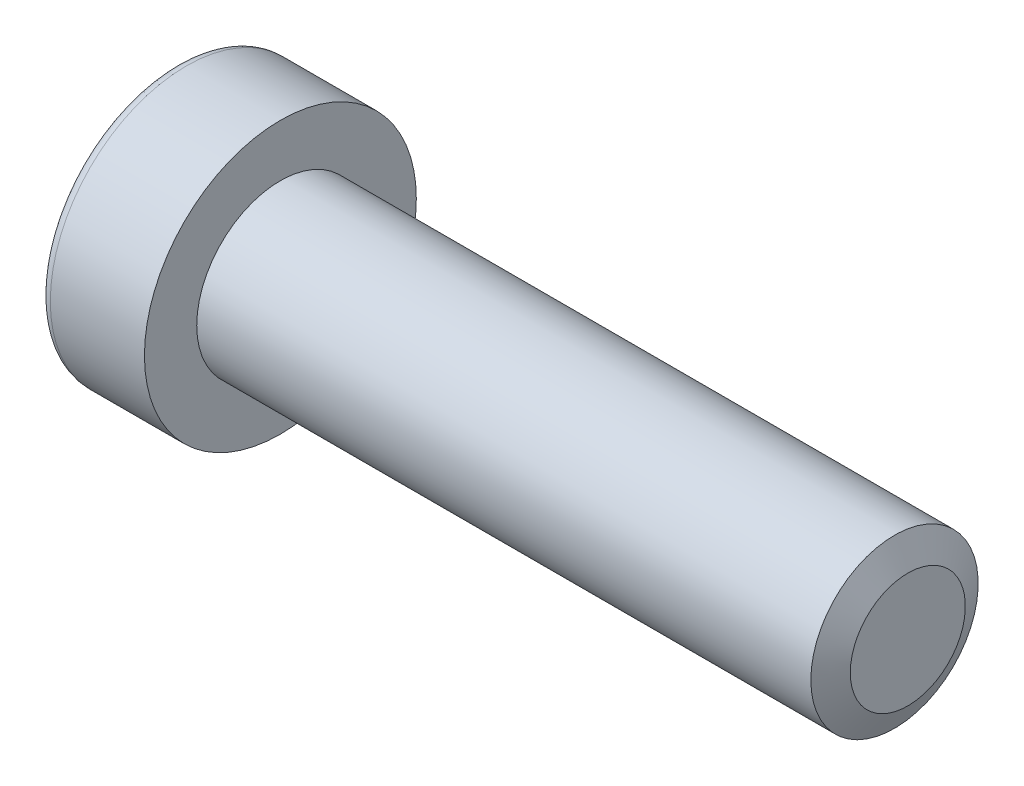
ISO-10303-21;
HEADER;
FILE_DESCRIPTION(('STEP AP214'),'2;1');
FILE_NAME('part.step','',(''),(''),'','','');
FILE_SCHEMA(('AUTOMOTIVE_DESIGN { 1 0 10303 214 1 1 1 1 }'));
ENDSEC;
DATA;
#1=APPLICATION_CONTEXT('core data for automotive mechanical design processes');
#2=APPLICATION_PROTOCOL_DEFINITION('international standard','automotive_design',2000,#1);
#3=PRODUCT_CONTEXT('',#1,'mechanical');
#4=PRODUCT('Part','Part','',(#3));
#5=PRODUCT_RELATED_PRODUCT_CATEGORY('part','',(#4));
#6=PRODUCT_DEFINITION_FORMATION('','',#4);
#7=PRODUCT_DEFINITION_CONTEXT('part definition',#1,'design');
#8=PRODUCT_DEFINITION('design','',#6,#7);
#9=PRODUCT_DEFINITION_SHAPE('','',#8);
#10=(LENGTH_UNIT() NAMED_UNIT(*) SI_UNIT(.MILLI.,.METRE.));
#11=(NAMED_UNIT(*) PLANE_ANGLE_UNIT() SI_UNIT($,.RADIAN.));
#12=(NAMED_UNIT(*) SI_UNIT($,.STERADIAN.) SOLID_ANGLE_UNIT());
#13=UNCERTAINTY_MEASURE_WITH_UNIT(LENGTH_MEASURE(1.E-05),#10,'distance_accuracy_value','');
#14=(GEOMETRIC_REPRESENTATION_CONTEXT(3) GLOBAL_UNCERTAINTY_ASSIGNED_CONTEXT((#13)) GLOBAL_UNIT_ASSIGNED_CONTEXT((#10,
#11,#12)) REPRESENTATION_CONTEXT('',''));
#15=CARTESIAN_POINT('',(0.,0.,0.));
#16=DIRECTION('',(0.,0.,1.));
#17=DIRECTION('',(1.,0.,0.));
#18=AXIS2_PLACEMENT_3D('',#15,#16,#17);
#19=CARTESIAN_POINT('',(-30.,6.5,0.));
#20=DIRECTION('',(-1.,0.,0.));
#21=DIRECTION('',(0.,0.,1.));
#22=AXIS2_PLACEMENT_3D('',#19,#20,#21);
#23=PLANE('',#22);
#24=CARTESIAN_POINT('',(-30.,0.,0.));
#25=DIRECTION('',(-1.,0.,0.));
#26=DIRECTION('',(0.,0.,1.));
#27=AXIS2_PLACEMENT_3D('',#24,#25,#26);
#28=CIRCLE('',#27,6.5);
#29=CARTESIAN_POINT('',(-30.,0.,6.5));
#30=VERTEX_POINT('',#29);
#31=EDGE_CURVE('E149',#30,#30,#28,.T.);
#32=ORIENTED_EDGE('',*,*,#31,.F.);
#33=EDGE_LOOP('',(#32));
#34=FACE_BOUND('',#33,.T.);
#35=CARTESIAN_POINT('',(-30.,0.,0.));
#36=DIRECTION('',(-1.,0.,0.));
#37=DIRECTION('',(0.,0.,1.));
#38=AXIS2_PLACEMENT_3D('',#35,#36,#37);
#39=CIRCLE('',#38,4.);
#40=CARTESIAN_POINT('',(-30.,0.,4.));
#41=VERTEX_POINT('',#40);
#42=EDGE_CURVE('E141',#41,#41,#39,.T.);
#43=ORIENTED_EDGE('',*,*,#42,.T.);
#44=EDGE_LOOP('',(#43));
#45=FACE_BOUND('',#44,.T.);
#46=ADVANCED_FACE('F39',(#34,#45),#23,.F.);
#47=CARTESIAN_POINT('',(-65.0118083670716,0.,0.));
#48=DIRECTION('',(-1.,0.,0.));
#49=DIRECTION('',(0.,0.,1.));
#50=AXIS2_PLACEMENT_3D('',#47,#48,#49);
#51=CYLINDRICAL_SURFACE('',#50,6.5);
#52=CARTESIAN_POINT('',(-34.5,0.,0.));
#53=DIRECTION('',(1.,0.,0.));
#54=DIRECTION('',(0.,0.,-1.));
#55=AXIS2_PLACEMENT_3D('',#52,#53,#54);
#56=CIRCLE('',#55,6.5);
#57=CARTESIAN_POINT('',(-34.5,0.,-6.5));
#58=VERTEX_POINT('',#57);
#59=EDGE_CURVE('E155',#58,#58,#56,.T.);
#60=ORIENTED_EDGE('',*,*,#59,.T.);
#61=EDGE_LOOP('',(#60));
#62=FACE_BOUND('',#61,.T.);
#63=ORIENTED_EDGE('',*,*,#31,.T.);
#64=EDGE_LOOP('',(#63));
#65=FACE_BOUND('',#64,.T.);
#66=ADVANCED_FACE('F172',(#62,#65),#51,.T.);
#67=CARTESIAN_POINT('',(-35.,0.,0.));
#68=DIRECTION('',(1.,0.,0.));
#69=DIRECTION('',(0.,0.,-1.));
#70=AXIS2_PLACEMENT_3D('',#67,#68,#69);
#71=PLANE('',#70);
#72=DIRECTION('',(0.,0.5,-0.866025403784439));
#73=VECTOR('',#72,1.);
#74=CARTESIAN_POINT('',(-35.,1.44337567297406,2.5));
#75=LINE('',#74,#73);
#76=CARTESIAN_POINT('',(-35.,1.44337567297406,2.5));
#77=VERTEX_POINT('',#76);
#78=CARTESIAN_POINT('',(-35.,2.88675134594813,0.));
#79=VERTEX_POINT('',#78);
#80=EDGE_CURVE('E128',#77,#79,#75,.T.);
#81=ORIENTED_EDGE('',*,*,#80,.F.);
#82=DIRECTION('',(0.,1.,0.));
#83=VECTOR('',#82,1.);
#84=CARTESIAN_POINT('',(-35.,-1.44337567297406,2.5));
#85=LINE('',#84,#83);
#86=CARTESIAN_POINT('',(-35.,-1.44337567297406,2.5));
#87=VERTEX_POINT('',#86);
#88=EDGE_CURVE('E54',#87,#77,#85,.T.);
#89=ORIENTED_EDGE('',*,*,#88,.F.);
#90=DIRECTION('',(0.,0.5,0.866025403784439));
#91=VECTOR('',#90,1.);
#92=CARTESIAN_POINT('',(-35.,-2.88675134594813,0.));
#93=LINE('',#92,#91);
#94=CARTESIAN_POINT('',(-35.,-2.88675134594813,0.));
#95=VERTEX_POINT('',#94);
#96=EDGE_CURVE('E137',#95,#87,#93,.T.);
#97=ORIENTED_EDGE('',*,*,#96,.F.);
#98=DIRECTION('',(0.,-0.5,0.866025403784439));
#99=VECTOR('',#98,1.);
#100=CARTESIAN_POINT('',(-35.,-1.44337567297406,-2.5));
#101=LINE('',#100,#99);
#102=CARTESIAN_POINT('',(-35.,-1.44337567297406,-2.5));
#103=VERTEX_POINT('',#102);
#104=EDGE_CURVE('E135',#103,#95,#101,.T.);
#105=ORIENTED_EDGE('',*,*,#104,.F.);
#106=DIRECTION('',(0.,-1.,0.));
#107=VECTOR('',#106,1.);
#108=CARTESIAN_POINT('',(-35.,1.44337567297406,-2.5));
#109=LINE('',#108,#107);
#110=CARTESIAN_POINT('',(-35.,1.44337567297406,-2.5));
#111=VERTEX_POINT('',#110);
#112=EDGE_CURVE('E102',#111,#103,#109,.T.);
#113=ORIENTED_EDGE('',*,*,#112,.F.);
#114=DIRECTION('',(0.,-0.5,-0.866025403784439));
#115=VECTOR('',#114,1.);
#116=CARTESIAN_POINT('',(-35.,2.88675134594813,0.));
#117=LINE('',#116,#115);
#118=EDGE_CURVE('E131',#79,#111,#117,.T.);
#119=ORIENTED_EDGE('',*,*,#118,.F.);
#120=EDGE_LOOP('',(#81,#89,#97,#105,#113,#119));
#121=FACE_BOUND('',#120,.T.);
#122=CARTESIAN_POINT('',(-35.,0.,0.));
#123=DIRECTION('',(1.,0.,0.));
#124=DIRECTION('',(0.,0.,-1.));
#125=AXIS2_PLACEMENT_3D('',#122,#123,#124);
#126=CIRCLE('',#125,6.);
#127=CARTESIAN_POINT('',(-35.,0.,-6.));
#128=VERTEX_POINT('',#127);
#129=EDGE_CURVE('E152',#128,#128,#126,.F.);
#130=ORIENTED_EDGE('',*,*,#129,.T.);
#131=EDGE_LOOP('',(#130));
#132=FACE_BOUND('',#131,.T.);
#133=ADVANCED_FACE('F178',(#121,#132),#71,.F.);
#134=CARTESIAN_POINT('',(0.,4.,0.));
#135=DIRECTION('',(-1.,0.,0.));
#136=DIRECTION('',(0.,0.,1.));
#137=AXIS2_PLACEMENT_3D('',#134,#135,#136);
#138=PLANE('',#137);
#139=CARTESIAN_POINT('',(0.,0.,0.));
#140=DIRECTION('',(-1.,0.,0.));
#141=DIRECTION('',(0.,0.,1.));
#142=AXIS2_PLACEMENT_3D('',#139,#140,#141);
#143=CIRCLE('',#142,2.74999999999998);
#144=CARTESIAN_POINT('',(0.,0.,2.74999999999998));
#145=VERTEX_POINT('',#144);
#146=EDGE_CURVE('E11',#145,#145,#143,.F.);
#147=ORIENTED_EDGE('',*,*,#146,.T.);
#148=EDGE_LOOP('',(#147));
#149=FACE_BOUND('',#148,.T.);
#150=ADVANCED_FACE('F194',(#149),#138,.F.);
#151=CARTESIAN_POINT('',(-65.0118083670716,0.,0.));
#152=DIRECTION('',(-1.,0.,0.));
#153=DIRECTION('',(0.,0.,1.));
#154=AXIS2_PLACEMENT_3D('',#151,#152,#153);
#155=CYLINDRICAL_SURFACE('',#154,4.);
#156=CARTESIAN_POINT('',(-0.636906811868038,0.,0.));
#157=DIRECTION('',(-1.,0.,0.));
#158=DIRECTION('',(0.,0.,1.));
#159=AXIS2_PLACEMENT_3D('',#156,#157,#158);
#160=CIRCLE('',#159,4.);
#161=CARTESIAN_POINT('',(-0.636906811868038,0.,4.));
#162=VERTEX_POINT('',#161);
#163=EDGE_CURVE('E47',#162,#162,#160,.T.);
#164=ORIENTED_EDGE('',*,*,#163,.T.);
#165=EDGE_LOOP('',(#164));
#166=FACE_BOUND('',#165,.T.);
#167=ORIENTED_EDGE('',*,*,#42,.F.);
#168=EDGE_LOOP('',(#167));
#169=FACE_BOUND('',#168,.T.);
#170=ADVANCED_FACE('F160',(#166,#169),#155,.T.);
#171=CARTESIAN_POINT('',(-34.5,0.,0.));
#172=DIRECTION('',(1.,0.,0.));
#173=DIRECTION('',(0.,0.,-1.));
#174=AXIS2_PLACEMENT_3D('',#171,#172,#173);
#175=TOROIDAL_SURFACE('',#174,6.,0.5);
#176=ORIENTED_EDGE('',*,*,#59,.F.);
#177=EDGE_LOOP('',(#176));
#178=FACE_BOUND('',#177,.T.);
#179=ORIENTED_EDGE('',*,*,#129,.F.);
#180=EDGE_LOOP('',(#179));
#181=FACE_BOUND('',#180,.T.);
#182=ADVANCED_FACE('F184',(#178,#181),#175,.T.);
#183=CARTESIAN_POINT('',(-32.,-1.44337567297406,2.5));
#184=DIRECTION('',(0.,0.,1.));
#185=DIRECTION('',(1.,0.,0.));
#186=AXIS2_PLACEMENT_3D('',#183,#184,#185);
#187=PLANE('',#186);
#188=ORIENTED_EDGE('',*,*,#88,.T.);
#189=DIRECTION('',(-1.,0.,0.));
#190=VECTOR('',#189,1.);
#191=CARTESIAN_POINT('',(-32.,1.44337567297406,2.5));
#192=LINE('',#191,#190);
#193=CARTESIAN_POINT('',(-32.,1.44337567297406,2.5));
#194=VERTEX_POINT('',#193);
#195=EDGE_CURVE('E84',#194,#77,#192,.T.);
#196=ORIENTED_EDGE('',*,*,#195,.F.);
#197=DIRECTION('',(0.,1.,0.));
#198=VECTOR('',#197,1.);
#199=CARTESIAN_POINT('',(-32.,-1.44337567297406,2.5));
#200=LINE('',#199,#198);
#201=CARTESIAN_POINT('',(-32.,-1.44337567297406,2.5));
#202=VERTEX_POINT('',#201);
#203=EDGE_CURVE('E139',#202,#194,#200,.T.);
#204=ORIENTED_EDGE('',*,*,#203,.F.);
#205=DIRECTION('',(-1.,0.,0.));
#206=VECTOR('',#205,1.);
#207=CARTESIAN_POINT('',(-32.,-1.44337567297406,2.5));
#208=LINE('',#207,#206);
#209=EDGE_CURVE('E62',#202,#87,#208,.T.);
#210=ORIENTED_EDGE('',*,*,#209,.T.);
#211=EDGE_LOOP('',(#188,#196,#204,#210));
#212=FACE_BOUND('',#211,.T.);
#213=ADVANCED_FACE('F186',(#212),#187,.F.);
#214=CARTESIAN_POINT('',(-32.,-2.88675134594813,0.));
#215=DIRECTION('',(0.,-0.866025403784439,0.5));
#216=DIRECTION('',(0.,-0.5,-0.866025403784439));
#217=AXIS2_PLACEMENT_3D('',#214,#215,#216);
#218=PLANE('',#217);
#219=ORIENTED_EDGE('',*,*,#96,.T.);
#220=ORIENTED_EDGE('',*,*,#209,.F.);
#221=DIRECTION('',(0.,0.5,0.866025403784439));
#222=VECTOR('',#221,1.);
#223=CARTESIAN_POINT('',(-32.,-2.88675134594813,0.));
#224=LINE('',#223,#222);
#225=CARTESIAN_POINT('',(-32.,-2.88675134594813,0.));
#226=VERTEX_POINT('',#225);
#227=EDGE_CURVE('E114',#226,#202,#224,.T.);
#228=ORIENTED_EDGE('',*,*,#227,.F.);
#229=DIRECTION('',(-1.,0.,0.));
#230=VECTOR('',#229,1.);
#231=CARTESIAN_POINT('',(-32.,-2.88675134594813,0.));
#232=LINE('',#231,#230);
#233=EDGE_CURVE('E106',#226,#95,#232,.T.);
#234=ORIENTED_EDGE('',*,*,#233,.T.);
#235=EDGE_LOOP('',(#219,#220,#228,#234));
#236=FACE_BOUND('',#235,.T.);
#237=ADVANCED_FACE('F192',(#236),#218,.F.);
#238=CARTESIAN_POINT('',(-32.,-1.44337567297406,-2.5));
#239=DIRECTION('',(0.,-0.866025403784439,-0.5));
#240=DIRECTION('',(0.,0.5,-0.866025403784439));
#241=AXIS2_PLACEMENT_3D('',#238,#239,#240);
#242=PLANE('',#241);
#243=ORIENTED_EDGE('',*,*,#104,.T.);
#244=ORIENTED_EDGE('',*,*,#233,.F.);
#245=DIRECTION('',(0.,-0.5,0.866025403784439));
#246=VECTOR('',#245,1.);
#247=CARTESIAN_POINT('',(-32.,-1.44337567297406,-2.5));
#248=LINE('',#247,#246);
#249=CARTESIAN_POINT('',(-32.,-1.44337567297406,-2.5));
#250=VERTEX_POINT('',#249);
#251=EDGE_CURVE('E110',#250,#226,#248,.T.);
#252=ORIENTED_EDGE('',*,*,#251,.F.);
#253=DIRECTION('',(-1.,0.,0.));
#254=VECTOR('',#253,1.);
#255=CARTESIAN_POINT('',(-32.,-1.44337567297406,-2.5));
#256=LINE('',#255,#254);
#257=EDGE_CURVE('E95',#250,#103,#256,.T.);
#258=ORIENTED_EDGE('',*,*,#257,.T.);
#259=EDGE_LOOP('',(#243,#244,#252,#258));
#260=FACE_BOUND('',#259,.T.);
#261=ADVANCED_FACE('F111',(#260),#242,.F.);
#262=CARTESIAN_POINT('',(-32.,1.44337567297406,-2.5));
#263=DIRECTION('',(0.,0.,-1.));
#264=DIRECTION('',(-1.,0.,0.));
#265=AXIS2_PLACEMENT_3D('',#262,#263,#264);
#266=PLANE('',#265);
#267=ORIENTED_EDGE('',*,*,#112,.T.);
#268=ORIENTED_EDGE('',*,*,#257,.F.);
#269=DIRECTION('',(0.,-1.,0.));
#270=VECTOR('',#269,1.);
#271=CARTESIAN_POINT('',(-32.,1.44337567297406,-2.5));
#272=LINE('',#271,#270);
#273=CARTESIAN_POINT('',(-32.,1.44337567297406,-2.5));
#274=VERTEX_POINT('',#273);
#275=EDGE_CURVE('E99',#274,#250,#272,.T.);
#276=ORIENTED_EDGE('',*,*,#275,.F.);
#277=DIRECTION('',(-1.,0.,0.));
#278=VECTOR('',#277,1.);
#279=CARTESIAN_POINT('',(-32.,1.44337567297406,-2.5));
#280=LINE('',#279,#278);
#281=EDGE_CURVE('E107',#274,#111,#280,.T.);
#282=ORIENTED_EDGE('',*,*,#281,.T.);
#283=EDGE_LOOP('',(#267,#268,#276,#282));
#284=FACE_BOUND('',#283,.T.);
#285=ADVANCED_FACE('F97',(#284),#266,.F.);
#286=CARTESIAN_POINT('',(-32.,2.88675134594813,0.));
#287=DIRECTION('',(0.,0.866025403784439,-0.5));
#288=DIRECTION('',(0.,0.5,0.866025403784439));
#289=AXIS2_PLACEMENT_3D('',#286,#287,#288);
#290=PLANE('',#289);
#291=ORIENTED_EDGE('',*,*,#118,.T.);
#292=ORIENTED_EDGE('',*,*,#281,.F.);
#293=DIRECTION('',(0.,-0.5,-0.866025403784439));
#294=VECTOR('',#293,1.);
#295=CARTESIAN_POINT('',(-32.,2.88675134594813,0.));
#296=LINE('',#295,#294);
#297=CARTESIAN_POINT('',(-32.,2.88675134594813,0.));
#298=VERTEX_POINT('',#297);
#299=EDGE_CURVE('E120',#298,#274,#296,.T.);
#300=ORIENTED_EDGE('',*,*,#299,.F.);
#301=DIRECTION('',(-1.,0.,0.));
#302=VECTOR('',#301,1.);
#303=CARTESIAN_POINT('',(-32.,2.88675134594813,0.));
#304=LINE('',#303,#302);
#305=EDGE_CURVE('E144',#298,#79,#304,.T.);
#306=ORIENTED_EDGE('',*,*,#305,.T.);
#307=EDGE_LOOP('',(#291,#292,#300,#306));
#308=FACE_BOUND('',#307,.T.);
#309=ADVANCED_FACE('F211',(#308),#290,.F.);
#310=CARTESIAN_POINT('',(-32.,1.44337567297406,2.5));
#311=DIRECTION('',(0.,0.866025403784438,0.5));
#312=DIRECTION('',(0.,-0.5,0.866025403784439));
#313=AXIS2_PLACEMENT_3D('',#310,#311,#312);
#314=PLANE('',#313);
#315=ORIENTED_EDGE('',*,*,#80,.T.);
#316=ORIENTED_EDGE('',*,*,#305,.F.);
#317=DIRECTION('',(0.,0.5,-0.866025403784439));
#318=VECTOR('',#317,1.);
#319=CARTESIAN_POINT('',(-32.,1.44337567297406,2.5));
#320=LINE('',#319,#318);
#321=EDGE_CURVE('E122',#194,#298,#320,.T.);
#322=ORIENTED_EDGE('',*,*,#321,.F.);
#323=ORIENTED_EDGE('',*,*,#195,.T.);
#324=EDGE_LOOP('',(#315,#316,#322,#323));
#325=FACE_BOUND('',#324,.T.);
#326=ADVANCED_FACE('F168',(#325),#314,.F.);
#327=CARTESIAN_POINT('',(-32.,0.,0.));
#328=DIRECTION('',(-1.,0.,0.));
#329=DIRECTION('',(0.,0.,1.));
#330=AXIS2_PLACEMENT_3D('',#327,#328,#329);
#331=PLANE('',#330);
#332=ORIENTED_EDGE('',*,*,#203,.T.);
#333=ORIENTED_EDGE('',*,*,#321,.T.);
#334=ORIENTED_EDGE('',*,*,#299,.T.);
#335=ORIENTED_EDGE('',*,*,#275,.T.);
#336=ORIENTED_EDGE('',*,*,#251,.T.);
#337=ORIENTED_EDGE('',*,*,#227,.T.);
#338=EDGE_LOOP('',(#332,#333,#334,#335,#336,#337));
#339=FACE_BOUND('',#338,.T.);
#340=ADVANCED_FACE('F117',(#339),#331,.T.);
#341=CARTESIAN_POINT('',(-0.636906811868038,0.,0.));
#342=DIRECTION('',(-1.,0.,0.));
#343=DIRECTION('',(0.,0.,1.));
#344=AXIS2_PLACEMENT_3D('',#341,#342,#343);
#345=CONICAL_SURFACE('',#344,4.,1.09955742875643);
#346=CARTESIAN_POINT('',(0.,0.,2.74999999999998));
#347=CARTESIAN_POINT('',(-0.00663444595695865,0.,2.76302083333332));
#348=CARTESIAN_POINT('',(-0.0132688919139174,0.,2.77604166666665));
#349=CARTESIAN_POINT('',(-0.026537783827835,0.,2.80208333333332));
#350=CARTESIAN_POINT('',(-0.0331722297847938,0.,2.81510416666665));
#351=CARTESIAN_POINT('',(-0.0464411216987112,0.,2.84114583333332));
#352=CARTESIAN_POINT('',(-0.0530755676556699,0.,2.85416666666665));
#353=CARTESIAN_POINT('',(-0.0663444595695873,0.,2.88020833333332));
#354=CARTESIAN_POINT('',(-0.0729789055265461,0.,2.89322916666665));
#355=CARTESIAN_POINT('',(-0.0862477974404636,0.,2.91927083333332));
#356=CARTESIAN_POINT('',(-0.0928822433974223,0.,2.93229166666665));
#357=CARTESIAN_POINT('',(-0.10615113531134,0.,2.95833333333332));
#358=CARTESIAN_POINT('',(-0.112785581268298,0.,2.97135416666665));
#359=CARTESIAN_POINT('',(-0.126054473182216,0.,2.99739583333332));
#360=CARTESIAN_POINT('',(-0.132688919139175,0.,3.01041666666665));
#361=CARTESIAN_POINT('',(-0.145957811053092,0.,3.03645833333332));
#362=CARTESIAN_POINT('',(-0.152592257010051,0.,3.04947916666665));
#363=CARTESIAN_POINT('',(-0.165861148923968,0.,3.07552083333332));
#364=CARTESIAN_POINT('',(-0.172495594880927,0.,3.08854166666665));
#365=CARTESIAN_POINT('',(-0.185764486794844,0.,3.11458333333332));
#366=CARTESIAN_POINT('',(-0.192398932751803,0.,3.12760416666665));
#367=CARTESIAN_POINT('',(-0.205667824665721,0.,3.15364583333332));
#368=CARTESIAN_POINT('',(-0.212302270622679,0.,3.16666666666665));
#369=CARTESIAN_POINT('',(-0.225571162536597,0.,3.19270833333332));
#370=CARTESIAN_POINT('',(-0.232205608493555,0.,3.20572916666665));
#371=CARTESIAN_POINT('',(-0.245474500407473,0.,3.23177083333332));
#372=CARTESIAN_POINT('',(-0.252108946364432,0.,3.24479166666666));
#373=CARTESIAN_POINT('',(-0.265377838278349,0.,3.27083333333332));
#374=CARTESIAN_POINT('',(-0.272012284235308,0.,3.28385416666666));
#375=CARTESIAN_POINT('',(-0.285281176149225,0.,3.30989583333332));
#376=CARTESIAN_POINT('',(-0.291915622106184,0.,3.32291666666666));
#377=CARTESIAN_POINT('',(-0.305184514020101,0.,3.34895833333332));
#378=CARTESIAN_POINT('',(-0.31181895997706,0.,3.36197916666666));
#379=CARTESIAN_POINT('',(-0.325087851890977,0.,3.38802083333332));
#380=CARTESIAN_POINT('',(-0.331722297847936,0.,3.40104166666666));
#381=CARTESIAN_POINT('',(-0.344991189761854,0.,3.42708333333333));
#382=CARTESIAN_POINT('',(-0.351625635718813,0.,3.44010416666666));
#383=CARTESIAN_POINT('',(-0.36489452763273,0.,3.46614583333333));
#384=CARTESIAN_POINT('',(-0.371528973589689,0.,3.47916666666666));
#385=CARTESIAN_POINT('',(-0.384797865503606,0.,3.50520833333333));
#386=CARTESIAN_POINT('',(-0.391432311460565,0.,3.51822916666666));
#387=CARTESIAN_POINT('',(-0.404701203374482,0.,3.54427083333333));
#388=CARTESIAN_POINT('',(-0.411335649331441,0.,3.55729166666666));
#389=CARTESIAN_POINT('',(-0.424604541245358,0.,3.58333333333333));
#390=CARTESIAN_POINT('',(-0.431238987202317,0.,3.59635416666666));
#391=CARTESIAN_POINT('',(-0.444507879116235,0.,3.62239583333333));
#392=CARTESIAN_POINT('',(-0.451142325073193,0.,3.63541666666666));
#393=CARTESIAN_POINT('',(-0.464411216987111,0.,3.66145833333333));
#394=CARTESIAN_POINT('',(-0.471045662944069,0.,3.67447916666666));
#395=CARTESIAN_POINT('',(-0.484314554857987,0.,3.70052083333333));
#396=CARTESIAN_POINT('',(-0.490949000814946,0.,3.71354166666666));
#397=CARTESIAN_POINT('',(-0.504217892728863,0.,3.73958333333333));
#398=CARTESIAN_POINT('',(-0.510852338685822,0.,3.75260416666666));
#399=CARTESIAN_POINT('',(-0.524121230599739,0.,3.77864583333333));
#400=CARTESIAN_POINT('',(-0.530755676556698,0.,3.79166666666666));
#401=CARTESIAN_POINT('',(-0.544024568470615,0.,3.81770833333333));
#402=CARTESIAN_POINT('',(-0.550659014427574,0.,3.83072916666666));
#403=CARTESIAN_POINT('',(-0.563927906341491,0.,3.85677083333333));
#404=CARTESIAN_POINT('',(-0.57056235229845,0.,3.86979166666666));
#405=CARTESIAN_POINT('',(-0.583831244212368,0.,3.89583333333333));
#406=CARTESIAN_POINT('',(-0.590465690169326,0.,3.90885416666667));
#407=CARTESIAN_POINT('',(-0.603734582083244,0.,3.93489583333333));
#408=CARTESIAN_POINT('',(-0.610369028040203,0.,3.94791666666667));
#409=CARTESIAN_POINT('',(-0.62363791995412,0.,3.97395833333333));
#410=CARTESIAN_POINT('',(-0.630272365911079,0.,3.98697916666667));
#411=CARTESIAN_POINT('',(-0.636906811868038,0.,4.));
#412=B_SPLINE_CURVE_WITH_KNOTS('',3,(#346,#347,#348,#349,#350,#351,#352,#353,#354,#355,#356,
#357,#358,#359,#360,#361,#362,#363,#364,#365,#366,#367,#368,#369,#370,#371,#372,#373,#374,#375,
#376,#377,#378,#379,#380,#381,#382,#383,#384,#385,#386,#387,#388,#389,#390,#391,#392,#393,#394,
#395,#396,#397,#398,#399,#400,#401,#402,#403,#404,#405,#406,#407,#408,#409,#410,#411),
.UNSPECIFIED.,.F.,.F.,(4,2,2,2,2,2,2,2,2,2,2,2,2,2,2,2,2,2,2,2,2,2,2,2,2,2,2,2,2,2,2,2,4),(0.,
0.043840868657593,0.0876817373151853,0.131522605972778,0.175363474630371,0.219204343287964,
0.263045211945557,0.306886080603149,0.350726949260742,0.394567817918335,0.438408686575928,
0.48224955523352,0.526090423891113,0.569931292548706,0.613772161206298,0.657613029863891,
0.701453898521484,0.745294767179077,0.789135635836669,0.832976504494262,0.876817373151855,
0.920658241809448,0.96449911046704,1.00833997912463,1.05218084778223,1.09602171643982,
1.13986258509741,1.183703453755,1.2275443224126,1.27138519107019,1.31522605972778,
1.35906692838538,1.40290779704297),.UNSPECIFIED.);
#413=EDGE_CURVE('BSEAM41',#145,#162,#412,.T.);
#414=ORIENTED_EDGE('',*,*,#146,.F.);
#415=ORIENTED_EDGE('',*,*,#163,.F.);
#416=ORIENTED_EDGE('',*,*,#413,.T.);
#417=ORIENTED_EDGE('',*,*,#413,.F.);
#418=EDGE_LOOP('',(#414,#416,#415,#417));
#419=FACE_BOUND('',#418,.T.);
#420=ADVANCED_FACE('F41',(#419),#345,.T.);
#421=CLOSED_SHELL('',(#46,#66,#133,#150,#170,#182,#213,#237,#261,#285,#309,#326,#340,#420));
#422=MANIFOLD_SOLID_BREP('B2',#421);
#423=ADVANCED_BREP_SHAPE_REPRESENTATION('',(#18,#422),#14);
#424=SHAPE_DEFINITION_REPRESENTATION(#9,#423);
ENDSEC;
END-ISO-10303-21;
